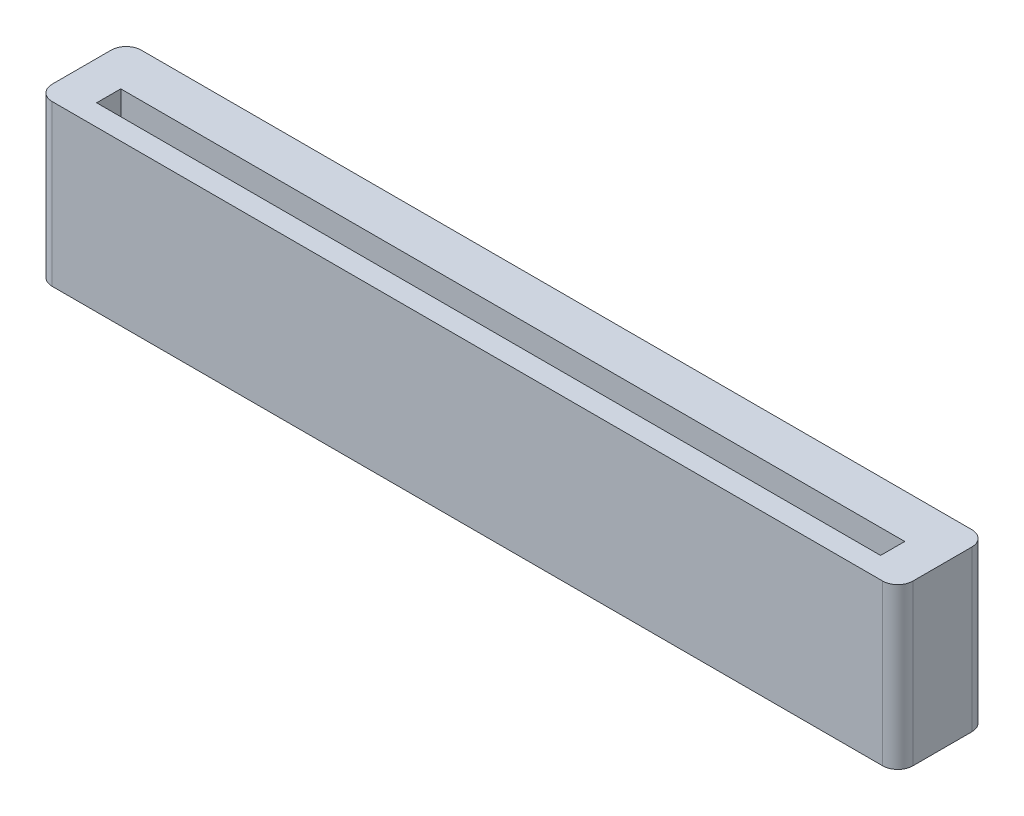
ISO-10303-21;
HEADER;
FILE_DESCRIPTION(('STEP AP214'),'2;1');
FILE_NAME('part.step','',(''),(''),'','','');
FILE_SCHEMA(('AUTOMOTIVE_DESIGN { 1 0 10303 214 1 1 1 1 }'));
ENDSEC;
DATA;
#1=APPLICATION_CONTEXT('core data for automotive mechanical design processes');
#2=APPLICATION_PROTOCOL_DEFINITION('international standard','automotive_design',2000,#1);
#3=PRODUCT_CONTEXT('',#1,'mechanical');
#4=PRODUCT('Part','Part','',(#3));
#5=PRODUCT_RELATED_PRODUCT_CATEGORY('part','',(#4));
#6=PRODUCT_DEFINITION_FORMATION('','',#4);
#7=PRODUCT_DEFINITION_CONTEXT('part definition',#1,'design');
#8=PRODUCT_DEFINITION('design','',#6,#7);
#9=PRODUCT_DEFINITION_SHAPE('','',#8);
#10=(LENGTH_UNIT() NAMED_UNIT(*) SI_UNIT(.MILLI.,.METRE.));
#11=(NAMED_UNIT(*) PLANE_ANGLE_UNIT() SI_UNIT($,.RADIAN.));
#12=(NAMED_UNIT(*) SI_UNIT($,.STERADIAN.) SOLID_ANGLE_UNIT());
#13=UNCERTAINTY_MEASURE_WITH_UNIT(LENGTH_MEASURE(1.E-05),#10,'distance_accuracy_value','');
#14=(GEOMETRIC_REPRESENTATION_CONTEXT(3) GLOBAL_UNCERTAINTY_ASSIGNED_CONTEXT((#13)) GLOBAL_UNIT_ASSIGNED_CONTEXT((#10,
#11,#12)) REPRESENTATION_CONTEXT('',''));
#15=CARTESIAN_POINT('',(0.,0.,0.));
#16=DIRECTION('',(0.,0.,1.));
#17=DIRECTION('',(1.,0.,0.));
#18=AXIS2_PLACEMENT_3D('',#15,#16,#17);
#19=CARTESIAN_POINT('',(1.,10.6,-4.9));
#20=DIRECTION('',(0.,-1.,0.));
#21=DIRECTION('',(0.,0.,-1.));
#22=AXIS2_PLACEMENT_3D('',#19,#20,#21);
#23=CYLINDRICAL_SURFACE('',#22,1.);
#24=CARTESIAN_POINT('',(1.,0.,-4.9));
#25=DIRECTION('',(0.,1.,0.));
#26=DIRECTION('',(0.,0.,1.));
#27=AXIS2_PLACEMENT_3D('',#24,#25,#26);
#28=CIRCLE('',#27,1.);
#29=CARTESIAN_POINT('',(1.,0.,-5.9));
#30=VERTEX_POINT('',#29);
#31=CARTESIAN_POINT('',(0.,0.,-4.9));
#32=VERTEX_POINT('',#31);
#33=EDGE_CURVE('E153',#30,#32,#28,.T.);
#34=ORIENTED_EDGE('',*,*,#33,.T.);
#35=DIRECTION('',(0.,-1.,0.));
#36=VECTOR('',#35,1.);
#37=CARTESIAN_POINT('',(0.,10.6,-4.9));
#38=LINE('',#37,#36);
#39=CARTESIAN_POINT('',(0.,10.6,-4.9));
#40=VERTEX_POINT('',#39);
#41=EDGE_CURVE('E11',#40,#32,#38,.T.);
#42=ORIENTED_EDGE('',*,*,#41,.F.);
#43=CARTESIAN_POINT('',(1.,10.6,-4.9));
#44=DIRECTION('',(0.,1.,0.));
#45=DIRECTION('',(0.,0.,1.));
#46=AXIS2_PLACEMENT_3D('',#43,#44,#45);
#47=CIRCLE('',#46,1.);
#48=CARTESIAN_POINT('',(1.,10.6,-5.9));
#49=VERTEX_POINT('',#48);
#50=EDGE_CURVE('E172',#49,#40,#47,.T.);
#51=ORIENTED_EDGE('',*,*,#50,.F.);
#52=DIRECTION('',(0.,-1.,0.));
#53=VECTOR('',#52,1.);
#54=CARTESIAN_POINT('',(1.,10.6,-5.9));
#55=LINE('',#54,#53);
#56=EDGE_CURVE('E187',#49,#30,#55,.T.);
#57=ORIENTED_EDGE('',*,*,#56,.T.);
#58=EDGE_LOOP('',(#34,#42,#51,#57));
#59=FACE_BOUND('',#58,.T.);
#60=ADVANCED_FACE('F27',(#59),#23,.T.);
#61=CARTESIAN_POINT('',(0.,10.6,-1.));
#62=DIRECTION('',(1.,0.,0.));
#63=DIRECTION('',(0.,0.,-1.));
#64=AXIS2_PLACEMENT_3D('',#61,#62,#63);
#65=PLANE('',#64);
#66=DIRECTION('',(0.,0.,1.));
#67=VECTOR('',#66,1.);
#68=CARTESIAN_POINT('',(0.,0.,-1.));
#69=LINE('',#68,#67);
#70=CARTESIAN_POINT('',(0.,0.,-1.));
#71=VERTEX_POINT('',#70);
#72=EDGE_CURVE('E158',#32,#71,#69,.T.);
#73=ORIENTED_EDGE('',*,*,#72,.T.);
#74=DIRECTION('',(0.,-1.,0.));
#75=VECTOR('',#74,1.);
#76=CARTESIAN_POINT('',(0.,10.6,-1.));
#77=LINE('',#76,#75);
#78=CARTESIAN_POINT('',(0.,10.6,-1.));
#79=VERTEX_POINT('',#78);
#80=EDGE_CURVE('E34',#79,#71,#77,.T.);
#81=ORIENTED_EDGE('',*,*,#80,.F.);
#82=DIRECTION('',(0.,0.,1.));
#83=VECTOR('',#82,1.);
#84=CARTESIAN_POINT('',(0.,10.6,-1.));
#85=LINE('',#84,#83);
#86=EDGE_CURVE('E174',#40,#79,#85,.T.);
#87=ORIENTED_EDGE('',*,*,#86,.F.);
#88=ORIENTED_EDGE('',*,*,#41,.T.);
#89=EDGE_LOOP('',(#73,#81,#87,#88));
#90=FACE_BOUND('',#89,.T.);
#91=ADVANCED_FACE('F230',(#90),#65,.F.);
#92=CARTESIAN_POINT('',(1.,10.6,-1.));
#93=DIRECTION('',(0.,-1.,0.));
#94=DIRECTION('',(0.,0.,-1.));
#95=AXIS2_PLACEMENT_3D('',#92,#93,#94);
#96=CYLINDRICAL_SURFACE('',#95,1.);
#97=CARTESIAN_POINT('',(1.,0.,-1.));
#98=DIRECTION('',(0.,1.,0.));
#99=DIRECTION('',(0.,0.,1.));
#100=AXIS2_PLACEMENT_3D('',#97,#98,#99);
#101=CIRCLE('',#100,1.);
#102=CARTESIAN_POINT('',(1.,0.,0.));
#103=VERTEX_POINT('',#102);
#104=EDGE_CURVE('E160',#71,#103,#101,.T.);
#105=ORIENTED_EDGE('',*,*,#104,.T.);
#106=DIRECTION('',(0.,-1.,0.));
#107=VECTOR('',#106,1.);
#108=CARTESIAN_POINT('',(1.,10.6,0.));
#109=LINE('',#108,#107);
#110=CARTESIAN_POINT('',(1.,10.6,0.));
#111=VERTEX_POINT('',#110);
#112=EDGE_CURVE('E202',#111,#103,#109,.T.);
#113=ORIENTED_EDGE('',*,*,#112,.F.);
#114=CARTESIAN_POINT('',(1.,10.6,-1.));
#115=DIRECTION('',(0.,1.,0.));
#116=DIRECTION('',(0.,0.,1.));
#117=AXIS2_PLACEMENT_3D('',#114,#115,#116);
#118=CIRCLE('',#117,1.);
#119=EDGE_CURVE('E176',#79,#111,#118,.T.);
#120=ORIENTED_EDGE('',*,*,#119,.F.);
#121=ORIENTED_EDGE('',*,*,#80,.T.);
#122=EDGE_LOOP('',(#105,#113,#120,#121));
#123=FACE_BOUND('',#122,.T.);
#124=ADVANCED_FACE('F209',(#123),#96,.T.);
#125=CARTESIAN_POINT('',(1.,10.6,0.));
#126=DIRECTION('',(0.,0.,-1.));
#127=DIRECTION('',(-1.,0.,0.));
#128=AXIS2_PLACEMENT_3D('',#125,#126,#127);
#129=PLANE('',#128);
#130=DIRECTION('',(1.,0.,0.));
#131=VECTOR('',#130,1.);
#132=CARTESIAN_POINT('',(1.,0.,0.));
#133=LINE('',#132,#131);
#134=CARTESIAN_POINT('',(56.,0.,0.));
#135=VERTEX_POINT('',#134);
#136=EDGE_CURVE('E162',#103,#135,#133,.T.);
#137=ORIENTED_EDGE('',*,*,#136,.T.);
#138=DIRECTION('',(0.,-1.,0.));
#139=VECTOR('',#138,1.);
#140=CARTESIAN_POINT('',(56.,10.6,0.));
#141=LINE('',#140,#139);
#142=CARTESIAN_POINT('',(56.,10.6,0.));
#143=VERTEX_POINT('',#142);
#144=EDGE_CURVE('E199',#143,#135,#141,.T.);
#145=ORIENTED_EDGE('',*,*,#144,.F.);
#146=DIRECTION('',(1.,0.,0.));
#147=VECTOR('',#146,1.);
#148=CARTESIAN_POINT('',(1.,10.6,0.));
#149=LINE('',#148,#147);
#150=EDGE_CURVE('E178',#111,#143,#149,.T.);
#151=ORIENTED_EDGE('',*,*,#150,.F.);
#152=ORIENTED_EDGE('',*,*,#112,.T.);
#153=EDGE_LOOP('',(#137,#145,#151,#152));
#154=FACE_BOUND('',#153,.T.);
#155=ADVANCED_FACE('F220',(#154),#129,.F.);
#156=CARTESIAN_POINT('',(56.,10.6,-1.));
#157=DIRECTION('',(0.,-1.,0.));
#158=DIRECTION('',(0.,0.,-1.));
#159=AXIS2_PLACEMENT_3D('',#156,#157,#158);
#160=CYLINDRICAL_SURFACE('',#159,1.);
#161=CARTESIAN_POINT('',(56.,0.,-1.));
#162=DIRECTION('',(0.,1.,0.));
#163=DIRECTION('',(0.,0.,-1.));
#164=AXIS2_PLACEMENT_3D('',#161,#162,#163);
#165=CIRCLE('',#164,1.);
#166=CARTESIAN_POINT('',(57.,0.,-1.));
#167=VERTEX_POINT('',#166);
#168=EDGE_CURVE('E164',#135,#167,#165,.T.);
#169=ORIENTED_EDGE('',*,*,#168,.T.);
#170=DIRECTION('',(0.,-1.,0.));
#171=VECTOR('',#170,1.);
#172=CARTESIAN_POINT('',(57.,10.6,-1.));
#173=LINE('',#172,#171);
#174=CARTESIAN_POINT('',(57.,10.6,-1.));
#175=VERTEX_POINT('',#174);
#176=EDGE_CURVE('E196',#175,#167,#173,.T.);
#177=ORIENTED_EDGE('',*,*,#176,.F.);
#178=CARTESIAN_POINT('',(56.,10.6,-1.));
#179=DIRECTION('',(0.,1.,0.));
#180=DIRECTION('',(0.,0.,-1.));
#181=AXIS2_PLACEMENT_3D('',#178,#179,#180);
#182=CIRCLE('',#181,1.);
#183=EDGE_CURVE('E180',#143,#175,#182,.T.);
#184=ORIENTED_EDGE('',*,*,#183,.F.);
#185=ORIENTED_EDGE('',*,*,#144,.T.);
#186=EDGE_LOOP('',(#169,#177,#184,#185));
#187=FACE_BOUND('',#186,.T.);
#188=ADVANCED_FACE('F224',(#187),#160,.T.);
#189=CARTESIAN_POINT('',(57.,10.6,-1.));
#190=DIRECTION('',(-1.,0.,0.));
#191=DIRECTION('',(0.,0.,1.));
#192=AXIS2_PLACEMENT_3D('',#189,#190,#191);
#193=PLANE('',#192);
#194=DIRECTION('',(0.,0.,-1.));
#195=VECTOR('',#194,1.);
#196=CARTESIAN_POINT('',(57.,0.,-1.));
#197=LINE('',#196,#195);
#198=CARTESIAN_POINT('',(57.,0.,-4.9));
#199=VERTEX_POINT('',#198);
#200=EDGE_CURVE('E166',#167,#199,#197,.T.);
#201=ORIENTED_EDGE('',*,*,#200,.T.);
#202=DIRECTION('',(0.,-1.,0.));
#203=VECTOR('',#202,1.);
#204=CARTESIAN_POINT('',(57.,10.6,-4.9));
#205=LINE('',#204,#203);
#206=CARTESIAN_POINT('',(57.,10.6,-4.9));
#207=VERTEX_POINT('',#206);
#208=EDGE_CURVE('E193',#207,#199,#205,.T.);
#209=ORIENTED_EDGE('',*,*,#208,.F.);
#210=DIRECTION('',(0.,0.,-1.));
#211=VECTOR('',#210,1.);
#212=CARTESIAN_POINT('',(57.,10.6,-1.));
#213=LINE('',#212,#211);
#214=EDGE_CURVE('E182',#175,#207,#213,.T.);
#215=ORIENTED_EDGE('',*,*,#214,.F.);
#216=ORIENTED_EDGE('',*,*,#176,.T.);
#217=EDGE_LOOP('',(#201,#209,#215,#216));
#218=FACE_BOUND('',#217,.T.);
#219=ADVANCED_FACE('F241',(#218),#193,.F.);
#220=CARTESIAN_POINT('',(56.,10.6,-4.9));
#221=DIRECTION('',(0.,-1.,0.));
#222=DIRECTION('',(0.,0.,-1.));
#223=AXIS2_PLACEMENT_3D('',#220,#221,#222);
#224=CYLINDRICAL_SURFACE('',#223,1.);
#225=CARTESIAN_POINT('',(56.,0.,-4.9));
#226=DIRECTION('',(0.,1.,0.));
#227=DIRECTION('',(0.,0.,1.));
#228=AXIS2_PLACEMENT_3D('',#225,#226,#227);
#229=CIRCLE('',#228,1.);
#230=CARTESIAN_POINT('',(56.,0.,-5.9));
#231=VERTEX_POINT('',#230);
#232=EDGE_CURVE('E168',#199,#231,#229,.T.);
#233=ORIENTED_EDGE('',*,*,#232,.T.);
#234=DIRECTION('',(0.,-1.,0.));
#235=VECTOR('',#234,1.);
#236=CARTESIAN_POINT('',(56.,10.6,-5.9));
#237=LINE('',#236,#235);
#238=CARTESIAN_POINT('',(56.,10.6,-5.9));
#239=VERTEX_POINT('',#238);
#240=EDGE_CURVE('E190',#239,#231,#237,.T.);
#241=ORIENTED_EDGE('',*,*,#240,.F.);
#242=CARTESIAN_POINT('',(56.,10.6,-4.9));
#243=DIRECTION('',(0.,1.,0.));
#244=DIRECTION('',(0.,0.,1.));
#245=AXIS2_PLACEMENT_3D('',#242,#243,#244);
#246=CIRCLE('',#245,1.);
#247=EDGE_CURVE('E184',#207,#239,#246,.T.);
#248=ORIENTED_EDGE('',*,*,#247,.F.);
#249=ORIENTED_EDGE('',*,*,#208,.T.);
#250=EDGE_LOOP('',(#233,#241,#248,#249));
#251=FACE_BOUND('',#250,.T.);
#252=ADVANCED_FACE('F239',(#251),#224,.T.);
#253=CARTESIAN_POINT('',(1.,10.6,-5.9));
#254=DIRECTION('',(0.,0.,1.));
#255=DIRECTION('',(1.,0.,0.));
#256=AXIS2_PLACEMENT_3D('',#253,#254,#255);
#257=PLANE('',#256);
#258=DIRECTION('',(-1.,0.,0.));
#259=VECTOR('',#258,1.);
#260=CARTESIAN_POINT('',(1.,0.,-5.9));
#261=LINE('',#260,#259);
#262=EDGE_CURVE('E170',#231,#30,#261,.T.);
#263=ORIENTED_EDGE('',*,*,#262,.T.);
#264=ORIENTED_EDGE('',*,*,#56,.F.);
#265=DIRECTION('',(-1.,0.,0.));
#266=VECTOR('',#265,1.);
#267=CARTESIAN_POINT('',(1.,10.6,-5.9));
#268=LINE('',#267,#266);
#269=EDGE_CURVE('E49',#239,#49,#268,.T.);
#270=ORIENTED_EDGE('',*,*,#269,.F.);
#271=ORIENTED_EDGE('',*,*,#240,.T.);
#272=EDGE_LOOP('',(#263,#264,#270,#271));
#273=FACE_BOUND('',#272,.T.);
#274=ADVANCED_FACE('F235',(#273),#257,.F.);
#275=CARTESIAN_POINT('',(1.,10.6,-4.9));
#276=DIRECTION('',(0.,1.,0.));
#277=DIRECTION('',(0.,0.,1.));
#278=AXIS2_PLACEMENT_3D('',#275,#276,#277);
#279=PLANE('',#278);
#280=DIRECTION('',(0.,0.,1.));
#281=VECTOR('',#280,1.);
#282=CARTESIAN_POINT('',(2.54,10.6,-3.));
#283=LINE('',#282,#281);
#284=CARTESIAN_POINT('',(2.54,10.6,-3.));
#285=VERTEX_POINT('',#284);
#286=CARTESIAN_POINT('',(2.54,10.6,-1.4));
#287=VERTEX_POINT('',#286);
#288=EDGE_CURVE('E41',#285,#287,#283,.T.);
#289=ORIENTED_EDGE('',*,*,#288,.F.);
#290=DIRECTION('',(-1.,0.,0.));
#291=VECTOR('',#290,1.);
#292=CARTESIAN_POINT('',(2.54,10.6,-3.));
#293=LINE('',#292,#291);
#294=CARTESIAN_POINT('',(54.46,10.6,-3.00000000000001));
#295=VERTEX_POINT('',#294);
#296=EDGE_CURVE('E137',#295,#285,#293,.T.);
#297=ORIENTED_EDGE('',*,*,#296,.F.);
#298=DIRECTION('',(0.,0.,-1.));
#299=VECTOR('',#298,1.);
#300=CARTESIAN_POINT('',(54.46,10.6,-3.00000000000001));
#301=LINE('',#300,#299);
#302=CARTESIAN_POINT('',(54.46,10.6,-1.40000000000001));
#303=VERTEX_POINT('',#302);
#304=EDGE_CURVE('E120',#303,#295,#301,.T.);
#305=ORIENTED_EDGE('',*,*,#304,.F.);
#306=DIRECTION('',(1.,0.,0.));
#307=VECTOR('',#306,1.);
#308=CARTESIAN_POINT('',(2.54,10.6,-1.4));
#309=LINE('',#308,#307);
#310=EDGE_CURVE('E131',#287,#303,#309,.T.);
#311=ORIENTED_EDGE('',*,*,#310,.F.);
#312=EDGE_LOOP('',(#289,#297,#305,#311));
#313=FACE_BOUND('',#312,.T.);
#314=ORIENTED_EDGE('',*,*,#50,.T.);
#315=ORIENTED_EDGE('',*,*,#86,.T.);
#316=ORIENTED_EDGE('',*,*,#119,.T.);
#317=ORIENTED_EDGE('',*,*,#150,.T.);
#318=ORIENTED_EDGE('',*,*,#183,.T.);
#319=ORIENTED_EDGE('',*,*,#214,.T.);
#320=ORIENTED_EDGE('',*,*,#247,.T.);
#321=ORIENTED_EDGE('',*,*,#269,.T.);
#322=EDGE_LOOP('',(#314,#315,#316,#317,#318,#319,#320,#321));
#323=FACE_BOUND('',#322,.T.);
#324=ADVANCED_FACE('F135',(#313,#323),#279,.T.);
#325=CARTESIAN_POINT('',(1.,0.,-4.9));
#326=DIRECTION('',(0.,1.,0.));
#327=DIRECTION('',(0.,0.,1.));
#328=AXIS2_PLACEMENT_3D('',#325,#326,#327);
#329=PLANE('',#328);
#330=ORIENTED_EDGE('',*,*,#33,.F.);
#331=ORIENTED_EDGE('',*,*,#262,.F.);
#332=ORIENTED_EDGE('',*,*,#232,.F.);
#333=ORIENTED_EDGE('',*,*,#200,.F.);
#334=ORIENTED_EDGE('',*,*,#168,.F.);
#335=ORIENTED_EDGE('',*,*,#136,.F.);
#336=ORIENTED_EDGE('',*,*,#104,.F.);
#337=ORIENTED_EDGE('',*,*,#72,.F.);
#338=EDGE_LOOP('',(#330,#331,#332,#333,#334,#335,#336,#337));
#339=FACE_BOUND('',#338,.T.);
#340=ADVANCED_FACE('F215',(#339),#329,.F.);
#341=CARTESIAN_POINT('',(2.54,4.6,-3.));
#342=DIRECTION('',(-1.,0.,0.));
#343=DIRECTION('',(0.,0.,1.));
#344=AXIS2_PLACEMENT_3D('',#341,#342,#343);
#345=PLANE('',#344);
#346=ORIENTED_EDGE('',*,*,#288,.T.);
#347=DIRECTION('',(0.,1.,0.));
#348=VECTOR('',#347,1.);
#349=CARTESIAN_POINT('',(2.54,4.6,-1.4));
#350=LINE('',#349,#348);
#351=CARTESIAN_POINT('',(2.54,4.6,-1.4));
#352=VERTEX_POINT('',#351);
#353=EDGE_CURVE('E128',#352,#287,#350,.T.);
#354=ORIENTED_EDGE('',*,*,#353,.F.);
#355=DIRECTION('',(0.,0.,1.));
#356=VECTOR('',#355,1.);
#357=CARTESIAN_POINT('',(2.54,4.6,-3.));
#358=LINE('',#357,#356);
#359=CARTESIAN_POINT('',(2.54,4.6,-3.));
#360=VERTEX_POINT('',#359);
#361=EDGE_CURVE('E139',#360,#352,#358,.T.);
#362=ORIENTED_EDGE('',*,*,#361,.F.);
#363=DIRECTION('',(0.,1.,0.));
#364=VECTOR('',#363,1.);
#365=CARTESIAN_POINT('',(2.54,4.6,-3.));
#366=LINE('',#365,#364);
#367=EDGE_CURVE('E151',#360,#285,#366,.T.);
#368=ORIENTED_EDGE('',*,*,#367,.T.);
#369=EDGE_LOOP('',(#346,#354,#362,#368));
#370=FACE_BOUND('',#369,.T.);
#371=ADVANCED_FACE('F294',(#370),#345,.F.);
#372=CARTESIAN_POINT('',(2.54,4.6,-3.));
#373=DIRECTION('',(0.,0.,-1.));
#374=DIRECTION('',(-1.,0.,0.));
#375=AXIS2_PLACEMENT_3D('',#372,#373,#374);
#376=PLANE('',#375);
#377=ORIENTED_EDGE('',*,*,#296,.T.);
#378=ORIENTED_EDGE('',*,*,#367,.F.);
#379=DIRECTION('',(-1.,0.,0.));
#380=VECTOR('',#379,1.);
#381=CARTESIAN_POINT('',(2.54,4.6,-3.));
#382=LINE('',#381,#380);
#383=CARTESIAN_POINT('',(54.46,4.6,-3.00000000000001));
#384=VERTEX_POINT('',#383);
#385=EDGE_CURVE('E148',#384,#360,#382,.T.);
#386=ORIENTED_EDGE('',*,*,#385,.F.);
#387=DIRECTION('',(0.,1.,0.));
#388=VECTOR('',#387,1.);
#389=CARTESIAN_POINT('',(54.46,4.6,-3.00000000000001));
#390=LINE('',#389,#388);
#391=EDGE_CURVE('E127',#384,#295,#390,.T.);
#392=ORIENTED_EDGE('',*,*,#391,.T.);
#393=EDGE_LOOP('',(#377,#378,#386,#392));
#394=FACE_BOUND('',#393,.T.);
#395=ADVANCED_FACE('F300',(#394),#376,.F.);
#396=CARTESIAN_POINT('',(54.46,4.6,-3.00000000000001));
#397=DIRECTION('',(1.,0.,0.));
#398=DIRECTION('',(0.,0.,-1.));
#399=AXIS2_PLACEMENT_3D('',#396,#397,#398);
#400=PLANE('',#399);
#401=ORIENTED_EDGE('',*,*,#304,.T.);
#402=ORIENTED_EDGE('',*,*,#391,.F.);
#403=DIRECTION('',(0.,0.,-1.));
#404=VECTOR('',#403,1.);
#405=CARTESIAN_POINT('',(54.46,4.6,-3.00000000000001));
#406=LINE('',#405,#404);
#407=CARTESIAN_POINT('',(54.46,4.6,-1.40000000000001));
#408=VERTEX_POINT('',#407);
#409=EDGE_CURVE('E123',#408,#384,#406,.T.);
#410=ORIENTED_EDGE('',*,*,#409,.F.);
#411=DIRECTION('',(0.,1.,0.));
#412=VECTOR('',#411,1.);
#413=CARTESIAN_POINT('',(54.46,4.6,-1.40000000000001));
#414=LINE('',#413,#412);
#415=EDGE_CURVE('E116',#408,#303,#414,.T.);
#416=ORIENTED_EDGE('',*,*,#415,.T.);
#417=EDGE_LOOP('',(#401,#402,#410,#416));
#418=FACE_BOUND('',#417,.T.);
#419=ADVANCED_FACE('F118',(#418),#400,.F.);
#420=CARTESIAN_POINT('',(2.54,4.6,-1.4));
#421=DIRECTION('',(0.,0.,1.));
#422=DIRECTION('',(1.,0.,0.));
#423=AXIS2_PLACEMENT_3D('',#420,#421,#422);
#424=PLANE('',#423);
#425=ORIENTED_EDGE('',*,*,#310,.T.);
#426=ORIENTED_EDGE('',*,*,#415,.F.);
#427=DIRECTION('',(1.,0.,0.));
#428=VECTOR('',#427,1.);
#429=CARTESIAN_POINT('',(2.54,4.6,-1.4));
#430=LINE('',#429,#428);
#431=EDGE_CURVE('E145',#352,#408,#430,.T.);
#432=ORIENTED_EDGE('',*,*,#431,.F.);
#433=ORIENTED_EDGE('',*,*,#353,.T.);
#434=EDGE_LOOP('',(#425,#426,#432,#433));
#435=FACE_BOUND('',#434,.T.);
#436=ADVANCED_FACE('F132',(#435),#424,.F.);
#437=CARTESIAN_POINT('',(2.54,4.6,-1.4));
#438=DIRECTION('',(0.,1.,0.));
#439=DIRECTION('',(0.,0.,1.));
#440=AXIS2_PLACEMENT_3D('',#437,#438,#439);
#441=PLANE('',#440);
#442=ORIENTED_EDGE('',*,*,#361,.T.);
#443=ORIENTED_EDGE('',*,*,#431,.T.);
#444=ORIENTED_EDGE('',*,*,#409,.T.);
#445=ORIENTED_EDGE('',*,*,#385,.T.);
#446=EDGE_LOOP('',(#442,#443,#444,#445));
#447=FACE_BOUND('',#446,.T.);
#448=ADVANCED_FACE('F320',(#447),#441,.T.);
#449=CLOSED_SHELL('',(#60,#91,#124,#155,#188,#219,#252,#274,#324,#340,#371,#395,#419,#436,#448));
#450=MANIFOLD_SOLID_BREP('B2',#449);
#451=ADVANCED_BREP_SHAPE_REPRESENTATION('',(#18,#450),#14);
#452=SHAPE_DEFINITION_REPRESENTATION(#9,#451);
ENDSEC;
END-ISO-10303-21;
